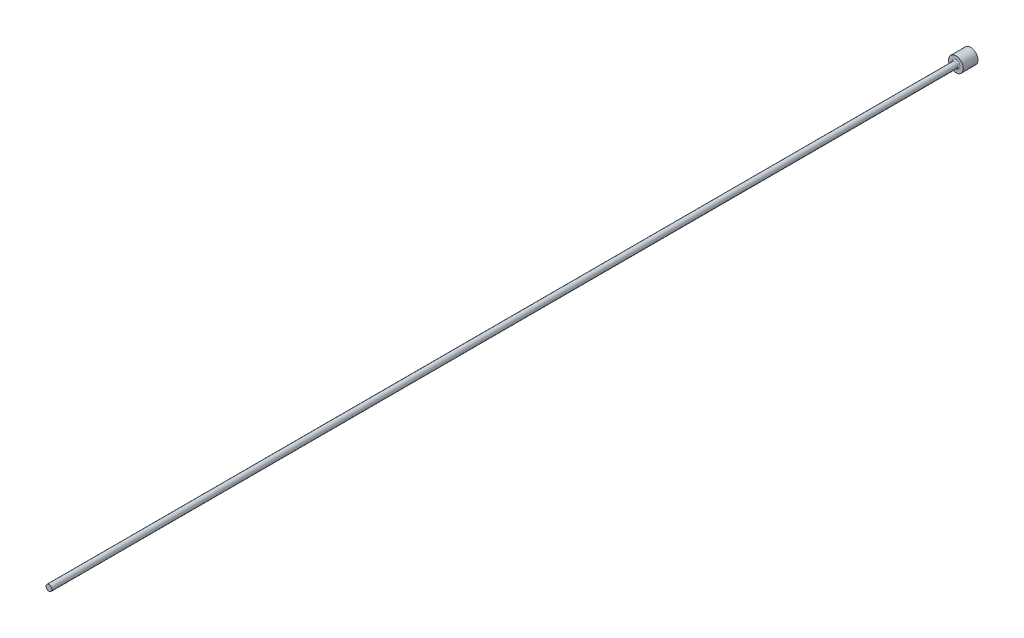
from build123d import *

# Parameters (mm, degrees)
FILLET1_R = 0.3


with BuildPart() as part:
    # FV → Revolve1 (revolve)
    with BuildSketch(Plane(origin=(0, 0, 0), x_dir=(1, 0, 0), z_dir=(0, 1, 0)), mode=Mode.PRIVATE) as revolve1_sk:
        Polygon((0, 0), (2, 0), (2, -4), (0.8, -4), (0.8, -250), (0, -250), align=None)
    revolve(revolve1_sk.sketch.rotate(Axis((0, 0, -9.033228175), (0, 0, 1)), 180), axis=Axis((0, 0, -9.033228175), (0, 0, 1)))

    # Fillet1
    fillet1_edges = [part.edges().sort_by_distance(p)[0] for p in [
        (0.8, 0, 4),
    ]]
    fillet(fillet1_edges, radius=FILLET1_R)


solid = part.part
